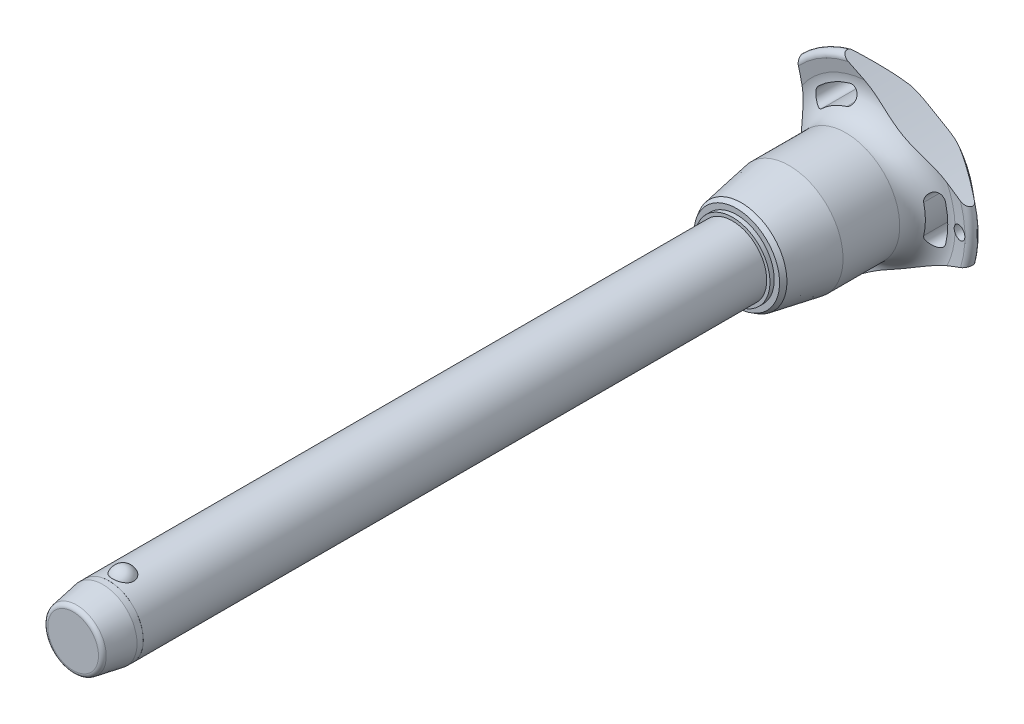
from build123d import *

# Parameters (mm, degrees)
SKETCH1_R           = 8
BOSS_EXTRUDE1_DEPTH = 140
SKETCH2_R           = 7
BOSS_EXTRUDE2_DEPTH = 39.7
BOSS_EXTRUDE3_START = 14
SKETCH1_2_R         = 8
BOSS_EXTRUDE3_DEPTH = 14
CHAMFER1_SIZE       = 7
CHAMFER1_SIZE2      = 1.234288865
FILLET1_R           = 1
SKETCH6_R           = 144.275
CUT_EXTRUDE1_DEPTH  = 183.827901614
CIRPATTERN1_COUNT   = 3
SKETCH7_R           = 1.5
CUT_EXTRUDE2_DEPTH  = 183.718098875
SKETCH8_R           = 8
SKETCH8_R_2         = 7.99
CUT_EXTRUDE3_DEPTH  = 8.4


with BuildPart() as part:
    # Sketch1 → Boss-Extrude1 (new body)
    with BuildSketch(Plane.XY):
        Circle(SKETCH1_R)
    extrude(amount=-BOSS_EXTRUDE1_DEPTH)

    # Sketch2 → Boss-Extrude2 (add)
    with BuildSketch(Plane(origin=(0, 0, -140), x_dir=(-1, 0, 0), z_dir=(0, 0, -1))):
        Circle(SKETCH2_R)
    extrude(amount=BOSS_EXTRUDE2_DEPTH)

    # Sketch3 → Revolve1 (revolve)
    with BuildSketch(Plane(origin=(0, 0, 0), x_dir=(0, 0, -1), z_dir=(1, 0, 0))):
        with BuildLine():
            Line((-2.387467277, 9.5), (-2.387467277, 4.2))
            ThreePointArc((-2.387467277, 4.2), (0.262532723, 6.85), (-2.387467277, 9.5))
        make_face()
        with BuildLine():
            Line((-2.387467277, -4.2), (-2.387467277, -9.5))
            ThreePointArc((-2.387467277, -9.5), (0.262532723, -6.85), (-2.387467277, -4.2))
        make_face()
    revolve(axis=Axis((0, -4.2, 2.387467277), (0, 1, 0)))

    # Sketch1_2 → Boss-Extrude3 (add)
    with BuildSketch(Plane.XY.offset(BOSS_EXTRUDE3_START)):
        Circle(SKETCH1_2_R)
    extrude(amount=-BOSS_EXTRUDE3_DEPTH)

    # Chamfer1
    chamfer1_edges = [part.edges().sort_by_distance(p)[0] for p in [
        (-8, 0, 14),
    ]]
    chamfer1_side = [part.faces().sort_by_distance(p)[0] for p in [
        (-8, 0, -63),
    ]]
    chamfer(chamfer1_edges, length=CHAMFER1_SIZE, length2=CHAMFER1_SIZE2, reference=chamfer1_side[0])

    # Fillet1
    fillet1_edges = [part.edges().sort_by_distance(p)[0] for p in [
        (-6.765711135, 0, 14),
        (7, 0, -179.7),
    ]]
    fillet(fillet1_edges, radius=FILLET1_R)

    # Sketch4 → Revolve2 (revolve)
    with BuildSketch(Plane(origin=(0, 0, 0), x_dir=(0, 0, -1), z_dir=(1, 0, 0)), mode=Mode.PRIVATE) as revolve2_sk:
        Polygon((140, 0), (140, 8.754868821), (141, 8.754868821), (141, 10.007796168), (142.085066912, 10.634259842), (153.233333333, 12.6), (166.466666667, 12.6), (166.466666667, 0), align=None)
    revolve(revolve2_sk.sketch.rotate(Axis((0, 0, -166.466666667), (0, 0, 1)), 90), axis=Axis((0, 0, -166.466666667), (0, 0, 1)))

    # Sketch5 → Revolve3 (revolve)
    with BuildSketch(Plane(origin=(0, 0, 0), x_dir=(0, 0, -1), z_dir=(1, 0, 0)), mode=Mode.PRIVATE) as revolve3_sk:
        with BuildLine():
            Line((172.379459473, 19.619255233), (171.900774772, 22.396148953))
            ThreePointArc((171.900774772, 22.396148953), (172.578274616, 23.688538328), (174.002586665, 23.371345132))
            Line((174.002586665, 23.371345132), (179.141488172, 17.247040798))
            ThreePointArc((179.141488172, 17.247040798), (179.7, 15.584758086), (178.978803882, 13.986322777))
            ThreePointArc((178.978803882, 13.986322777), (174.617427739, 7.589034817), (173.083333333, 0))
            Line((173.083333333, 0), (166.466666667, 0))
            Line((166.466666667, 0), (166.466666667, 12.6))
            ThreePointArc((166.466666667, 12.6), (171.055540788, 14.734481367), (172.379459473, 19.619255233))
        make_face()
    revolve(revolve3_sk.sketch.rotate(Axis((0, 0, -173.083333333), (0, 0, 1)), 90), axis=Axis((0, 0, -173.083333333), (0, 0, 1)))

    # Sketch6 → Cut-Extrude1 (cut, through all)
    with BuildSketch(Plane.XY):
        with Locations((-159.975, 0)):
            Circle(SKETCH6_R)
        with BuildLine():
            ThreePointArc((17.365443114, -4.192809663), (17.864441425, 0), (17.365443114, 4.192809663))
            ThreePointArc((17.365443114, 4.192809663), (15.247788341, 5.486749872), (13.953848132, 3.369095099))
            ThreePointArc((13.953848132, 3.369095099), (14.354813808, 0), (13.953848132, -3.369095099))
            ThreePointArc((13.953848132, -3.369095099), (15.247788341, -5.486749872), (17.365443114, -4.192809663))
        make_face()
    cut_extrude1 = extrude(amount=-CUT_EXTRUDE1_DEPTH, mode=Mode.SUBTRACT)

    # CirPattern1: Cut-Extrude1 ×3 about axis
    cirpattern1_axis = Axis((0, 0, 0), (0, 0, 1))
    for i in range(1, CIRPATTERN1_COUNT):
        add(cut_extrude1.rotate(cirpattern1_axis, i * 360 / CIRPATTERN1_COUNT), mode=Mode.SUBTRACT)

    # Sketch7 → Cut-Extrude2 (cut, through all)
    with BuildSketch(Plane.XY):
        with Locations(Location((20.864441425, 0, 0), (0, 0, 221.008319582))):
            Circle(SKETCH7_R)
    extrude(amount=-CUT_EXTRUDE2_DEPTH, mode=Mode.SUBTRACT)

    # Sketch8 → Cut-Extrude3 (cut)
    with BuildSketch(Plane.XY.offset(14)):
        Circle(SKETCH8_R)
        Circle(SKETCH8_R_2, mode=Mode.SUBTRACT)
    extrude(amount=-CUT_EXTRUDE3_DEPTH, mode=Mode.SUBTRACT)


solid = part.part
